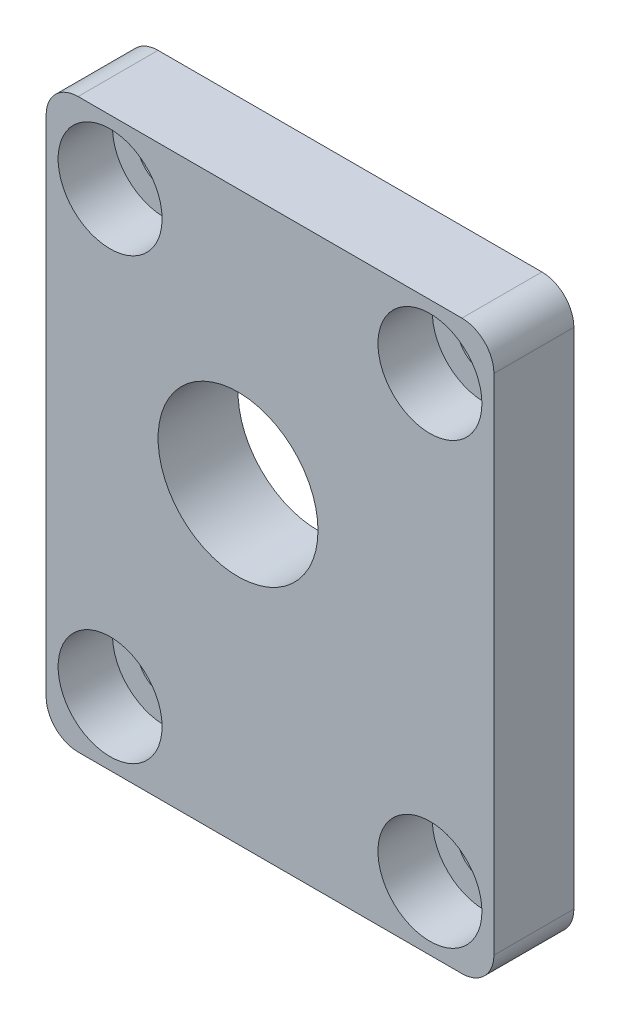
ISO-10303-21;
HEADER;
FILE_DESCRIPTION(('STEP AP214'),'2;1');
FILE_NAME('part.step','',(''),(''),'','','');
FILE_SCHEMA(('AUTOMOTIVE_DESIGN { 1 0 10303 214 1 1 1 1 }'));
ENDSEC;
DATA;
#1=APPLICATION_CONTEXT('core data for automotive mechanical design processes');
#2=APPLICATION_PROTOCOL_DEFINITION('international standard','automotive_design',2000,#1);
#3=PRODUCT_CONTEXT('',#1,'mechanical');
#4=PRODUCT('Part','Part','',(#3));
#5=PRODUCT_RELATED_PRODUCT_CATEGORY('part','',(#4));
#6=PRODUCT_DEFINITION_FORMATION('','',#4);
#7=PRODUCT_DEFINITION_CONTEXT('part definition',#1,'design');
#8=PRODUCT_DEFINITION('design','',#6,#7);
#9=PRODUCT_DEFINITION_SHAPE('','',#8);
#10=(LENGTH_UNIT() NAMED_UNIT(*) SI_UNIT(.MILLI.,.METRE.));
#11=(NAMED_UNIT(*) PLANE_ANGLE_UNIT() SI_UNIT($,.RADIAN.));
#12=(NAMED_UNIT(*) SI_UNIT($,.STERADIAN.) SOLID_ANGLE_UNIT());
#13=UNCERTAINTY_MEASURE_WITH_UNIT(LENGTH_MEASURE(1.E-05),#10,'distance_accuracy_value','');
#14=(GEOMETRIC_REPRESENTATION_CONTEXT(3) GLOBAL_UNCERTAINTY_ASSIGNED_CONTEXT((#13)) GLOBAL_UNIT_ASSIGNED_CONTEXT((#10,
#11,#12)) REPRESENTATION_CONTEXT('',''));
#15=CARTESIAN_POINT('',(0.,0.,0.));
#16=DIRECTION('',(0.,0.,1.));
#17=DIRECTION('',(1.,0.,0.));
#18=AXIS2_PLACEMENT_3D('',#15,#16,#17);
#19=CARTESIAN_POINT('',(0.,0.,5.));
#20=DIRECTION('',(0.,0.,-1.));
#21=DIRECTION('',(-1.,0.,0.));
#22=AXIS2_PLACEMENT_3D('',#19,#20,#21);
#23=PLANE('',#22);
#24=CARTESIAN_POINT('',(-10.,13.75,5.));
#25=DIRECTION('',(0.,0.,1.));
#26=DIRECTION('',(1.,0.,0.));
#27=AXIS2_PLACEMENT_3D('',#24,#25,#26);
#28=CIRCLE('',#27,3.25);
#29=CARTESIAN_POINT('',(-6.75,13.75,5.));
#30=VERTEX_POINT('',#29);
#31=EDGE_CURVE('E275',#30,#30,#28,.T.);
#32=ORIENTED_EDGE('',*,*,#31,.F.);
#33=EDGE_LOOP('',(#32));
#34=FACE_BOUND('',#33,.T.);
#35=CARTESIAN_POINT('',(10.,13.75,5.));
#36=DIRECTION('',(0.,0.,1.));
#37=DIRECTION('',(1.,0.,0.));
#38=AXIS2_PLACEMENT_3D('',#35,#36,#37);
#39=CIRCLE('',#38,3.25);
#40=CARTESIAN_POINT('',(13.25,13.75,5.));
#41=VERTEX_POINT('',#40);
#42=EDGE_CURVE('E259',#41,#41,#39,.T.);
#43=ORIENTED_EDGE('',*,*,#42,.F.);
#44=EDGE_LOOP('',(#43));
#45=FACE_BOUND('',#44,.T.);
#46=CARTESIAN_POINT('',(10.,-13.75,5.));
#47=DIRECTION('',(0.,0.,1.));
#48=DIRECTION('',(1.,0.,0.));
#49=AXIS2_PLACEMENT_3D('',#46,#47,#48);
#50=CIRCLE('',#49,3.25);
#51=CARTESIAN_POINT('',(13.25,-13.75,5.));
#52=VERTEX_POINT('',#51);
#53=EDGE_CURVE('E243',#52,#52,#50,.T.);
#54=ORIENTED_EDGE('',*,*,#53,.F.);
#55=EDGE_LOOP('',(#54));
#56=FACE_BOUND('',#55,.T.);
#57=CARTESIAN_POINT('',(-10.,-13.75,5.));
#58=DIRECTION('',(0.,0.,1.));
#59=DIRECTION('',(1.,0.,0.));
#60=AXIS2_PLACEMENT_3D('',#57,#58,#59);
#61=CIRCLE('',#60,3.25);
#62=CARTESIAN_POINT('',(-6.75,-13.75,5.));
#63=VERTEX_POINT('',#62);
#64=EDGE_CURVE('E227',#63,#63,#61,.T.);
#65=ORIENTED_EDGE('',*,*,#64,.F.);
#66=EDGE_LOOP('',(#65));
#67=FACE_BOUND('',#66,.T.);
#68=DIRECTION('',(1.,0.,0.));
#69=VECTOR('',#68,1.);
#70=CARTESIAN_POINT('',(-14.,-17.75,5.));
#71=LINE('',#70,#69);
#72=CARTESIAN_POINT('',(-12.,-17.75,5.));
#73=VERTEX_POINT('',#72);
#74=CARTESIAN_POINT('',(12.,-17.75,5.));
#75=VERTEX_POINT('',#74);
#76=EDGE_CURVE('E147',#73,#75,#71,.T.);
#77=ORIENTED_EDGE('',*,*,#76,.T.);
#78=CARTESIAN_POINT('',(12.,-15.75,5.));
#79=DIRECTION('',(0.,0.,-1.));
#80=DIRECTION('',(-1.,0.,0.));
#81=AXIS2_PLACEMENT_3D('',#78,#79,#80);
#82=CIRCLE('',#81,2.);
#83=CARTESIAN_POINT('',(14.,-15.75,5.));
#84=VERTEX_POINT('',#83);
#85=EDGE_CURVE('E177',#75,#84,#82,.F.);
#86=ORIENTED_EDGE('',*,*,#85,.T.);
#87=DIRECTION('',(0.,1.,0.));
#88=VECTOR('',#87,1.);
#89=CARTESIAN_POINT('',(14.,-17.75,5.));
#90=LINE('',#89,#88);
#91=CARTESIAN_POINT('',(14.,15.75,5.));
#92=VERTEX_POINT('',#91);
#93=EDGE_CURVE('E125',#84,#92,#90,.T.);
#94=ORIENTED_EDGE('',*,*,#93,.T.);
#95=CARTESIAN_POINT('',(12.,15.75,5.));
#96=DIRECTION('',(0.,0.,-1.));
#97=DIRECTION('',(-1.,0.,0.));
#98=AXIS2_PLACEMENT_3D('',#95,#96,#97);
#99=CIRCLE('',#98,2.);
#100=CARTESIAN_POINT('',(12.,17.75,5.));
#101=VERTEX_POINT('',#100);
#102=EDGE_CURVE('E174',#92,#101,#99,.F.);
#103=ORIENTED_EDGE('',*,*,#102,.T.);
#104=DIRECTION('',(-1.,0.,0.));
#105=VECTOR('',#104,1.);
#106=CARTESIAN_POINT('',(-14.,17.75,5.));
#107=LINE('',#106,#105);
#108=CARTESIAN_POINT('',(-12.,17.75,5.));
#109=VERTEX_POINT('',#108);
#110=EDGE_CURVE('E205',#101,#109,#107,.T.);
#111=ORIENTED_EDGE('',*,*,#110,.T.);
#112=CARTESIAN_POINT('',(-12.,15.75,5.));
#113=DIRECTION('',(0.,0.,-1.));
#114=DIRECTION('',(-1.,0.,0.));
#115=AXIS2_PLACEMENT_3D('',#112,#113,#114);
#116=CIRCLE('',#115,2.);
#117=CARTESIAN_POINT('',(-14.,15.75,5.));
#118=VERTEX_POINT('',#117);
#119=EDGE_CURVE('E59',#109,#118,#116,.F.);
#120=ORIENTED_EDGE('',*,*,#119,.T.);
#121=DIRECTION('',(0.,-1.,0.));
#122=VECTOR('',#121,1.);
#123=CARTESIAN_POINT('',(-14.,-17.75,5.));
#124=LINE('',#123,#122);
#125=CARTESIAN_POINT('',(-14.,-15.75,5.));
#126=VERTEX_POINT('',#125);
#127=EDGE_CURVE('E192',#118,#126,#124,.T.);
#128=ORIENTED_EDGE('',*,*,#127,.T.);
#129=CARTESIAN_POINT('',(-12.,-15.75,5.));
#130=DIRECTION('',(0.,0.,-1.));
#131=DIRECTION('',(-1.,0.,0.));
#132=AXIS2_PLACEMENT_3D('',#129,#130,#131);
#133=CIRCLE('',#132,2.);
#134=EDGE_CURVE('E171',#126,#73,#133,.F.);
#135=ORIENTED_EDGE('',*,*,#134,.T.);
#136=EDGE_LOOP('',(#77,#86,#94,#103,#111,#120,#128,#135));
#137=FACE_BOUND('',#136,.T.);
#138=CARTESIAN_POINT('',(-2.,1.75,5.));
#139=DIRECTION('',(0.,0.,1.));
#140=DIRECTION('',(1.,0.,0.));
#141=AXIS2_PLACEMENT_3D('',#138,#139,#140);
#142=CIRCLE('',#141,5.);
#143=CARTESIAN_POINT('',(3.00000000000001,1.75,5.));
#144=VERTEX_POINT('',#143);
#145=EDGE_CURVE('E135',#144,#144,#142,.T.);
#146=ORIENTED_EDGE('',*,*,#145,.F.);
#147=EDGE_LOOP('',(#146));
#148=FACE_BOUND('',#147,.T.);
#149=ADVANCED_FACE('F38',(#34,#45,#56,#67,#137,#148),#23,.F.);
#150=CARTESIAN_POINT('',(0.,0.,0.));
#151=DIRECTION('',(0.,0.,-1.));
#152=DIRECTION('',(-1.,0.,0.));
#153=AXIS2_PLACEMENT_3D('',#150,#151,#152);
#154=PLANE('',#153);
#155=CARTESIAN_POINT('',(-10.,13.75,0.));
#156=DIRECTION('',(0.,0.,1.));
#157=DIRECTION('',(1.,0.,0.));
#158=AXIS2_PLACEMENT_3D('',#155,#156,#157);
#159=CIRCLE('',#158,1.7);
#160=CARTESIAN_POINT('',(-8.3,13.75,0.));
#161=VERTEX_POINT('',#160);
#162=EDGE_CURVE('E263',#161,#161,#159,.T.);
#163=ORIENTED_EDGE('',*,*,#162,.T.);
#164=EDGE_LOOP('',(#163));
#165=FACE_BOUND('',#164,.T.);
#166=CARTESIAN_POINT('',(10.,13.75,0.));
#167=DIRECTION('',(0.,0.,1.));
#168=DIRECTION('',(1.,0.,0.));
#169=AXIS2_PLACEMENT_3D('',#166,#167,#168);
#170=CIRCLE('',#169,1.7);
#171=CARTESIAN_POINT('',(11.7,13.75,0.));
#172=VERTEX_POINT('',#171);
#173=EDGE_CURVE('E247',#172,#172,#170,.T.);
#174=ORIENTED_EDGE('',*,*,#173,.T.);
#175=EDGE_LOOP('',(#174));
#176=FACE_BOUND('',#175,.T.);
#177=CARTESIAN_POINT('',(10.,-13.75,0.));
#178=DIRECTION('',(0.,0.,1.));
#179=DIRECTION('',(1.,0.,0.));
#180=AXIS2_PLACEMENT_3D('',#177,#178,#179);
#181=CIRCLE('',#180,1.7);
#182=CARTESIAN_POINT('',(11.7,-13.75,0.));
#183=VERTEX_POINT('',#182);
#184=EDGE_CURVE('E231',#183,#183,#181,.T.);
#185=ORIENTED_EDGE('',*,*,#184,.T.);
#186=EDGE_LOOP('',(#185));
#187=FACE_BOUND('',#186,.T.);
#188=CARTESIAN_POINT('',(-10.,-13.75,0.));
#189=DIRECTION('',(0.,0.,1.));
#190=DIRECTION('',(1.,0.,0.));
#191=AXIS2_PLACEMENT_3D('',#188,#189,#190);
#192=CIRCLE('',#191,1.7);
#193=CARTESIAN_POINT('',(-8.3,-13.75,0.));
#194=VERTEX_POINT('',#193);
#195=EDGE_CURVE('E214',#194,#194,#192,.T.);
#196=ORIENTED_EDGE('',*,*,#195,.T.);
#197=EDGE_LOOP('',(#196));
#198=FACE_BOUND('',#197,.T.);
#199=DIRECTION('',(0.,1.,0.));
#200=VECTOR('',#199,1.);
#201=CARTESIAN_POINT('',(14.,-17.75,0.));
#202=LINE('',#201,#200);
#203=CARTESIAN_POINT('',(14.,-15.75,0.));
#204=VERTEX_POINT('',#203);
#205=CARTESIAN_POINT('',(14.,15.75,0.));
#206=VERTEX_POINT('',#205);
#207=EDGE_CURVE('E122',#204,#206,#202,.T.);
#208=ORIENTED_EDGE('',*,*,#207,.F.);
#209=CARTESIAN_POINT('',(12.,-15.75,0.));
#210=DIRECTION('',(0.,0.,-1.));
#211=DIRECTION('',(-1.,0.,0.));
#212=AXIS2_PLACEMENT_3D('',#209,#210,#211);
#213=CIRCLE('',#212,2.);
#214=CARTESIAN_POINT('',(12.,-17.75,0.));
#215=VERTEX_POINT('',#214);
#216=EDGE_CURVE('E104',#204,#215,#213,.T.);
#217=ORIENTED_EDGE('',*,*,#216,.T.);
#218=DIRECTION('',(1.,0.,0.));
#219=VECTOR('',#218,1.);
#220=CARTESIAN_POINT('',(-14.,-17.75,0.));
#221=LINE('',#220,#219);
#222=CARTESIAN_POINT('',(-12.,-17.75,0.));
#223=VERTEX_POINT('',#222);
#224=EDGE_CURVE('E152',#223,#215,#221,.T.);
#225=ORIENTED_EDGE('',*,*,#224,.F.);
#226=CARTESIAN_POINT('',(-12.,-15.75,0.));
#227=DIRECTION('',(0.,0.,-1.));
#228=DIRECTION('',(-1.,0.,0.));
#229=AXIS2_PLACEMENT_3D('',#226,#227,#228);
#230=CIRCLE('',#229,2.);
#231=CARTESIAN_POINT('',(-14.,-15.75,0.));
#232=VERTEX_POINT('',#231);
#233=EDGE_CURVE('E159',#223,#232,#230,.T.);
#234=ORIENTED_EDGE('',*,*,#233,.T.);
#235=DIRECTION('',(0.,-1.,0.));
#236=VECTOR('',#235,1.);
#237=CARTESIAN_POINT('',(-14.,-17.75,0.));
#238=LINE('',#237,#236);
#239=CARTESIAN_POINT('',(-14.,15.75,0.));
#240=VERTEX_POINT('',#239);
#241=EDGE_CURVE('E141',#240,#232,#238,.T.);
#242=ORIENTED_EDGE('',*,*,#241,.F.);
#243=CARTESIAN_POINT('',(-12.,15.75,0.));
#244=DIRECTION('',(0.,0.,-1.));
#245=DIRECTION('',(-1.,0.,0.));
#246=AXIS2_PLACEMENT_3D('',#243,#244,#245);
#247=CIRCLE('',#246,2.);
#248=CARTESIAN_POINT('',(-12.,17.75,0.));
#249=VERTEX_POINT('',#248);
#250=EDGE_CURVE('E127',#240,#249,#247,.T.);
#251=ORIENTED_EDGE('',*,*,#250,.T.);
#252=DIRECTION('',(-1.,0.,0.));
#253=VECTOR('',#252,1.);
#254=CARTESIAN_POINT('',(-14.,17.75,0.));
#255=LINE('',#254,#253);
#256=CARTESIAN_POINT('',(12.,17.75,0.));
#257=VERTEX_POINT('',#256);
#258=EDGE_CURVE('E134',#257,#249,#255,.T.);
#259=ORIENTED_EDGE('',*,*,#258,.F.);
#260=CARTESIAN_POINT('',(12.,15.75,0.));
#261=DIRECTION('',(0.,0.,-1.));
#262=DIRECTION('',(-1.,0.,0.));
#263=AXIS2_PLACEMENT_3D('',#260,#261,#262);
#264=CIRCLE('',#263,2.);
#265=EDGE_CURVE('E116',#257,#206,#264,.T.);
#266=ORIENTED_EDGE('',*,*,#265,.T.);
#267=EDGE_LOOP('',(#208,#217,#225,#234,#242,#251,#259,#266));
#268=FACE_BOUND('',#267,.T.);
#269=CARTESIAN_POINT('',(-2.,1.75,0.));
#270=DIRECTION('',(0.,0.,1.));
#271=DIRECTION('',(1.,0.,0.));
#272=AXIS2_PLACEMENT_3D('',#269,#270,#271);
#273=CIRCLE('',#272,5.);
#274=CARTESIAN_POINT('',(3.00000000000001,1.75,0.));
#275=VERTEX_POINT('',#274);
#276=EDGE_CURVE('E144',#275,#275,#273,.T.);
#277=ORIENTED_EDGE('',*,*,#276,.T.);
#278=EDGE_LOOP('',(#277));
#279=FACE_BOUND('',#278,.T.);
#280=ADVANCED_FACE('F130',(#165,#176,#187,#198,#268,#279),#154,.T.);
#281=CARTESIAN_POINT('',(14.,-17.75,5.));
#282=DIRECTION('',(-1.,0.,0.));
#283=DIRECTION('',(0.,0.,1.));
#284=AXIS2_PLACEMENT_3D('',#281,#282,#283);
#285=PLANE('',#284);
#286=ORIENTED_EDGE('',*,*,#93,.F.);
#287=DIRECTION('',(0.,0.,-1.));
#288=VECTOR('',#287,1.);
#289=CARTESIAN_POINT('',(14.,-15.75,5.));
#290=LINE('',#289,#288);
#291=EDGE_CURVE('E108',#84,#204,#290,.T.);
#292=ORIENTED_EDGE('',*,*,#291,.T.);
#293=ORIENTED_EDGE('',*,*,#207,.T.);
#294=DIRECTION('',(0.,0.,-1.));
#295=VECTOR('',#294,1.);
#296=CARTESIAN_POINT('',(14.,15.75,5.));
#297=LINE('',#296,#295);
#298=EDGE_CURVE('E128',#206,#92,#297,.F.);
#299=ORIENTED_EDGE('',*,*,#298,.T.);
#300=EDGE_LOOP('',(#286,#292,#293,#299));
#301=FACE_BOUND('',#300,.T.);
#302=ADVANCED_FACE('F121',(#301),#285,.F.);
#303=CARTESIAN_POINT('',(-14.,17.75,5.));
#304=DIRECTION('',(0.,-1.,0.));
#305=DIRECTION('',(0.,0.,-1.));
#306=AXIS2_PLACEMENT_3D('',#303,#304,#305);
#307=PLANE('',#306);
#308=ORIENTED_EDGE('',*,*,#110,.F.);
#309=DIRECTION('',(0.,0.,-1.));
#310=VECTOR('',#309,1.);
#311=CARTESIAN_POINT('',(12.,17.75,5.));
#312=LINE('',#311,#310);
#313=EDGE_CURVE('E183',#101,#257,#312,.T.);
#314=ORIENTED_EDGE('',*,*,#313,.T.);
#315=ORIENTED_EDGE('',*,*,#258,.T.);
#316=DIRECTION('',(0.,0.,-1.));
#317=VECTOR('',#316,1.);
#318=CARTESIAN_POINT('',(-12.,17.75,5.));
#319=LINE('',#318,#317);
#320=EDGE_CURVE('E180',#249,#109,#319,.F.);
#321=ORIENTED_EDGE('',*,*,#320,.T.);
#322=EDGE_LOOP('',(#308,#314,#315,#321));
#323=FACE_BOUND('',#322,.T.);
#324=ADVANCED_FACE('F306',(#323),#307,.F.);
#325=CARTESIAN_POINT('',(-14.,-17.75,5.));
#326=DIRECTION('',(1.,0.,0.));
#327=DIRECTION('',(0.,0.,-1.));
#328=AXIS2_PLACEMENT_3D('',#325,#326,#327);
#329=PLANE('',#328);
#330=ORIENTED_EDGE('',*,*,#241,.T.);
#331=DIRECTION('',(0.,0.,-1.));
#332=VECTOR('',#331,1.);
#333=CARTESIAN_POINT('',(-14.,-15.75,5.));
#334=LINE('',#333,#332);
#335=EDGE_CURVE('E11',#232,#126,#334,.F.);
#336=ORIENTED_EDGE('',*,*,#335,.T.);
#337=ORIENTED_EDGE('',*,*,#127,.F.);
#338=DIRECTION('',(0.,0.,-1.));
#339=VECTOR('',#338,1.);
#340=CARTESIAN_POINT('',(-14.,15.75,5.));
#341=LINE('',#340,#339);
#342=EDGE_CURVE('E47',#118,#240,#341,.T.);
#343=ORIENTED_EDGE('',*,*,#342,.T.);
#344=EDGE_LOOP('',(#330,#336,#337,#343));
#345=FACE_BOUND('',#344,.T.);
#346=ADVANCED_FACE('F191',(#345),#329,.F.);
#347=CARTESIAN_POINT('',(-14.,-17.75,5.));
#348=DIRECTION('',(0.,1.,0.));
#349=DIRECTION('',(0.,0.,1.));
#350=AXIS2_PLACEMENT_3D('',#347,#348,#349);
#351=PLANE('',#350);
#352=ORIENTED_EDGE('',*,*,#224,.T.);
#353=DIRECTION('',(0.,0.,-1.));
#354=VECTOR('',#353,1.);
#355=CARTESIAN_POINT('',(12.,-17.75,5.));
#356=LINE('',#355,#354);
#357=EDGE_CURVE('E109',#215,#75,#356,.F.);
#358=ORIENTED_EDGE('',*,*,#357,.T.);
#359=ORIENTED_EDGE('',*,*,#76,.F.);
#360=DIRECTION('',(0.,0.,-1.));
#361=VECTOR('',#360,1.);
#362=CARTESIAN_POINT('',(-12.,-17.75,5.));
#363=LINE('',#362,#361);
#364=EDGE_CURVE('E115',#73,#223,#363,.T.);
#365=ORIENTED_EDGE('',*,*,#364,.T.);
#366=EDGE_LOOP('',(#352,#358,#359,#365));
#367=FACE_BOUND('',#366,.T.);
#368=ADVANCED_FACE('F200',(#367),#351,.F.);
#369=CARTESIAN_POINT('',(-2.,1.75,5.));
#370=DIRECTION('',(0.,0.,-1.));
#371=DIRECTION('',(-1.,0.,0.));
#372=AXIS2_PLACEMENT_3D('',#369,#370,#371);
#373=CYLINDRICAL_SURFACE('',#372,5.);
#374=ORIENTED_EDGE('',*,*,#145,.T.);
#375=EDGE_LOOP('',(#374));
#376=FACE_BOUND('',#375,.T.);
#377=ORIENTED_EDGE('',*,*,#276,.F.);
#378=EDGE_LOOP('',(#377));
#379=FACE_BOUND('',#378,.T.);
#380=ADVANCED_FACE('F294',(#376,#379),#373,.F.);
#381=CARTESIAN_POINT('',(-10.,-13.75,5.));
#382=DIRECTION('',(0.,0.,1.));
#383=DIRECTION('',(1.,0.,0.));
#384=AXIS2_PLACEMENT_3D('',#381,#382,#383);
#385=CYLINDRICAL_SURFACE('',#384,1.70000000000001);
#386=ORIENTED_EDGE('',*,*,#195,.F.);
#387=EDGE_LOOP('',(#386));
#388=FACE_BOUND('',#387,.T.);
#389=CARTESIAN_POINT('',(-10.,-13.75,1.6));
#390=DIRECTION('',(0.,0.,1.));
#391=DIRECTION('',(1.,0.,0.));
#392=AXIS2_PLACEMENT_3D('',#389,#390,#391);
#393=CIRCLE('',#392,1.70000000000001);
#394=CARTESIAN_POINT('',(-8.29999999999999,-13.75,1.6));
#395=VERTEX_POINT('',#394);
#396=EDGE_CURVE('E219',#395,#395,#393,.T.);
#397=ORIENTED_EDGE('',*,*,#396,.T.);
#398=EDGE_LOOP('',(#397));
#399=FACE_BOUND('',#398,.T.);
#400=ADVANCED_FACE('F297',(#388,#399),#385,.F.);
#401=CARTESIAN_POINT('',(-8.29999999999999,-13.75,1.6));
#402=DIRECTION('',(0.,0.,-1.));
#403=DIRECTION('',(-1.,0.,0.));
#404=AXIS2_PLACEMENT_3D('',#401,#402,#403);
#405=PLANE('',#404);
#406=ORIENTED_EDGE('',*,*,#396,.F.);
#407=EDGE_LOOP('',(#406));
#408=FACE_BOUND('',#407,.T.);
#409=CARTESIAN_POINT('',(-10.,-13.75,1.6));
#410=DIRECTION('',(0.,0.,1.));
#411=DIRECTION('',(1.,0.,0.));
#412=AXIS2_PLACEMENT_3D('',#409,#410,#411);
#413=CIRCLE('',#412,3.25);
#414=CARTESIAN_POINT('',(-6.75,-13.75,1.6));
#415=VERTEX_POINT('',#414);
#416=EDGE_CURVE('E223',#415,#415,#413,.T.);
#417=ORIENTED_EDGE('',*,*,#416,.T.);
#418=EDGE_LOOP('',(#417));
#419=FACE_BOUND('',#418,.T.);
#420=ADVANCED_FACE('F449',(#408,#419),#405,.F.);
#421=CARTESIAN_POINT('',(-10.,-13.75,5.));
#422=DIRECTION('',(0.,0.,1.));
#423=DIRECTION('',(1.,0.,0.));
#424=AXIS2_PLACEMENT_3D('',#421,#422,#423);
#425=CYLINDRICAL_SURFACE('',#424,3.25);
#426=ORIENTED_EDGE('',*,*,#416,.F.);
#427=EDGE_LOOP('',(#426));
#428=FACE_BOUND('',#427,.T.);
#429=ORIENTED_EDGE('',*,*,#64,.T.);
#430=EDGE_LOOP('',(#429));
#431=FACE_BOUND('',#430,.T.);
#432=ADVANCED_FACE('F439',(#428,#431),#425,.F.);
#433=CARTESIAN_POINT('',(10.,-13.75,5.));
#434=DIRECTION('',(0.,0.,1.));
#435=DIRECTION('',(1.,0.,0.));
#436=AXIS2_PLACEMENT_3D('',#433,#434,#435);
#437=CYLINDRICAL_SURFACE('',#436,1.70000000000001);
#438=ORIENTED_EDGE('',*,*,#184,.F.);
#439=EDGE_LOOP('',(#438));
#440=FACE_BOUND('',#439,.T.);
#441=CARTESIAN_POINT('',(10.,-13.75,1.6));
#442=DIRECTION('',(0.,0.,1.));
#443=DIRECTION('',(1.,0.,0.));
#444=AXIS2_PLACEMENT_3D('',#441,#442,#443);
#445=CIRCLE('',#444,1.70000000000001);
#446=CARTESIAN_POINT('',(11.7,-13.75,1.6));
#447=VERTEX_POINT('',#446);
#448=EDGE_CURVE('E235',#447,#447,#445,.T.);
#449=ORIENTED_EDGE('',*,*,#448,.T.);
#450=EDGE_LOOP('',(#449));
#451=FACE_BOUND('',#450,.T.);
#452=ADVANCED_FACE('F429',(#440,#451),#437,.F.);
#453=CARTESIAN_POINT('',(11.7,-13.75,1.6));
#454=DIRECTION('',(0.,0.,-1.));
#455=DIRECTION('',(-1.,0.,0.));
#456=AXIS2_PLACEMENT_3D('',#453,#454,#455);
#457=PLANE('',#456);
#458=ORIENTED_EDGE('',*,*,#448,.F.);
#459=EDGE_LOOP('',(#458));
#460=FACE_BOUND('',#459,.T.);
#461=CARTESIAN_POINT('',(10.,-13.75,1.6));
#462=DIRECTION('',(0.,0.,1.));
#463=DIRECTION('',(1.,0.,0.));
#464=AXIS2_PLACEMENT_3D('',#461,#462,#463);
#465=CIRCLE('',#464,3.25);
#466=CARTESIAN_POINT('',(13.25,-13.75,1.6));
#467=VERTEX_POINT('',#466);
#468=EDGE_CURVE('E239',#467,#467,#465,.T.);
#469=ORIENTED_EDGE('',*,*,#468,.T.);
#470=EDGE_LOOP('',(#469));
#471=FACE_BOUND('',#470,.T.);
#472=ADVANCED_FACE('F419',(#460,#471),#457,.F.);
#473=CARTESIAN_POINT('',(10.,-13.75,5.));
#474=DIRECTION('',(0.,0.,1.));
#475=DIRECTION('',(1.,0.,0.));
#476=AXIS2_PLACEMENT_3D('',#473,#474,#475);
#477=CYLINDRICAL_SURFACE('',#476,3.25);
#478=ORIENTED_EDGE('',*,*,#468,.F.);
#479=EDGE_LOOP('',(#478));
#480=FACE_BOUND('',#479,.T.);
#481=ORIENTED_EDGE('',*,*,#53,.T.);
#482=EDGE_LOOP('',(#481));
#483=FACE_BOUND('',#482,.T.);
#484=ADVANCED_FACE('F409',(#480,#483),#477,.F.);
#485=CARTESIAN_POINT('',(10.,13.75,5.));
#486=DIRECTION('',(0.,0.,1.));
#487=DIRECTION('',(1.,0.,0.));
#488=AXIS2_PLACEMENT_3D('',#485,#486,#487);
#489=CYLINDRICAL_SURFACE('',#488,1.70000000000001);
#490=ORIENTED_EDGE('',*,*,#173,.F.);
#491=EDGE_LOOP('',(#490));
#492=FACE_BOUND('',#491,.T.);
#493=CARTESIAN_POINT('',(10.,13.75,1.6));
#494=DIRECTION('',(0.,0.,1.));
#495=DIRECTION('',(1.,0.,0.));
#496=AXIS2_PLACEMENT_3D('',#493,#494,#495);
#497=CIRCLE('',#496,1.70000000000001);
#498=CARTESIAN_POINT('',(11.7,13.75,1.6));
#499=VERTEX_POINT('',#498);
#500=EDGE_CURVE('E251',#499,#499,#497,.T.);
#501=ORIENTED_EDGE('',*,*,#500,.T.);
#502=EDGE_LOOP('',(#501));
#503=FACE_BOUND('',#502,.T.);
#504=ADVANCED_FACE('F399',(#492,#503),#489,.F.);
#505=CARTESIAN_POINT('',(11.7,13.75,1.6));
#506=DIRECTION('',(0.,0.,-1.));
#507=DIRECTION('',(-1.,0.,0.));
#508=AXIS2_PLACEMENT_3D('',#505,#506,#507);
#509=PLANE('',#508);
#510=ORIENTED_EDGE('',*,*,#500,.F.);
#511=EDGE_LOOP('',(#510));
#512=FACE_BOUND('',#511,.T.);
#513=CARTESIAN_POINT('',(10.,13.75,1.6));
#514=DIRECTION('',(0.,0.,1.));
#515=DIRECTION('',(1.,0.,0.));
#516=AXIS2_PLACEMENT_3D('',#513,#514,#515);
#517=CIRCLE('',#516,3.25);
#518=CARTESIAN_POINT('',(13.25,13.75,1.6));
#519=VERTEX_POINT('',#518);
#520=EDGE_CURVE('E255',#519,#519,#517,.T.);
#521=ORIENTED_EDGE('',*,*,#520,.T.);
#522=EDGE_LOOP('',(#521));
#523=FACE_BOUND('',#522,.T.);
#524=ADVANCED_FACE('F389',(#512,#523),#509,.F.);
#525=CARTESIAN_POINT('',(10.,13.75,5.));
#526=DIRECTION('',(0.,0.,1.));
#527=DIRECTION('',(1.,0.,0.));
#528=AXIS2_PLACEMENT_3D('',#525,#526,#527);
#529=CYLINDRICAL_SURFACE('',#528,3.25);
#530=ORIENTED_EDGE('',*,*,#520,.F.);
#531=EDGE_LOOP('',(#530));
#532=FACE_BOUND('',#531,.T.);
#533=ORIENTED_EDGE('',*,*,#42,.T.);
#534=EDGE_LOOP('',(#533));
#535=FACE_BOUND('',#534,.T.);
#536=ADVANCED_FACE('F379',(#532,#535),#529,.F.);
#537=CARTESIAN_POINT('',(-10.,13.75,5.));
#538=DIRECTION('',(0.,0.,1.));
#539=DIRECTION('',(1.,0.,0.));
#540=AXIS2_PLACEMENT_3D('',#537,#538,#539);
#541=CYLINDRICAL_SURFACE('',#540,1.70000000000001);
#542=ORIENTED_EDGE('',*,*,#162,.F.);
#543=EDGE_LOOP('',(#542));
#544=FACE_BOUND('',#543,.T.);
#545=CARTESIAN_POINT('',(-10.,13.75,1.6));
#546=DIRECTION('',(0.,0.,1.));
#547=DIRECTION('',(1.,0.,0.));
#548=AXIS2_PLACEMENT_3D('',#545,#546,#547);
#549=CIRCLE('',#548,1.70000000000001);
#550=CARTESIAN_POINT('',(-8.29999999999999,13.75,1.6));
#551=VERTEX_POINT('',#550);
#552=EDGE_CURVE('E267',#551,#551,#549,.T.);
#553=ORIENTED_EDGE('',*,*,#552,.T.);
#554=EDGE_LOOP('',(#553));
#555=FACE_BOUND('',#554,.T.);
#556=ADVANCED_FACE('F369',(#544,#555),#541,.F.);
#557=CARTESIAN_POINT('',(-8.29999999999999,13.75,1.6));
#558=DIRECTION('',(0.,0.,-1.));
#559=DIRECTION('',(-1.,0.,0.));
#560=AXIS2_PLACEMENT_3D('',#557,#558,#559);
#561=PLANE('',#560);
#562=ORIENTED_EDGE('',*,*,#552,.F.);
#563=EDGE_LOOP('',(#562));
#564=FACE_BOUND('',#563,.T.);
#565=CARTESIAN_POINT('',(-10.,13.75,1.6));
#566=DIRECTION('',(0.,0.,1.));
#567=DIRECTION('',(1.,0.,0.));
#568=AXIS2_PLACEMENT_3D('',#565,#566,#567);
#569=CIRCLE('',#568,3.25);
#570=CARTESIAN_POINT('',(-6.75,13.75,1.6));
#571=VERTEX_POINT('',#570);
#572=EDGE_CURVE('E271',#571,#571,#569,.T.);
#573=ORIENTED_EDGE('',*,*,#572,.T.);
#574=EDGE_LOOP('',(#573));
#575=FACE_BOUND('',#574,.T.);
#576=ADVANCED_FACE('F358',(#564,#575),#561,.F.);
#577=CARTESIAN_POINT('',(-10.,13.75,5.));
#578=DIRECTION('',(0.,0.,1.));
#579=DIRECTION('',(1.,0.,0.));
#580=AXIS2_PLACEMENT_3D('',#577,#578,#579);
#581=CYLINDRICAL_SURFACE('',#580,3.25);
#582=ORIENTED_EDGE('',*,*,#572,.F.);
#583=EDGE_LOOP('',(#582));
#584=FACE_BOUND('',#583,.T.);
#585=ORIENTED_EDGE('',*,*,#31,.T.);
#586=EDGE_LOOP('',(#585));
#587=FACE_BOUND('',#586,.T.);
#588=ADVANCED_FACE('F281',(#584,#587),#581,.F.);
#589=CARTESIAN_POINT('',(12.,-15.75,5.));
#590=DIRECTION('',(0.,0.,-1.));
#591=DIRECTION('',(-1.,0.,0.));
#592=AXIS2_PLACEMENT_3D('',#589,#590,#591);
#593=CYLINDRICAL_SURFACE('',#592,2.);
#594=ORIENTED_EDGE('',*,*,#85,.F.);
#595=ORIENTED_EDGE('',*,*,#357,.F.);
#596=ORIENTED_EDGE('',*,*,#216,.F.);
#597=ORIENTED_EDGE('',*,*,#291,.F.);
#598=EDGE_LOOP('',(#594,#595,#596,#597));
#599=FACE_BOUND('',#598,.T.);
#600=ADVANCED_FACE('F107',(#599),#593,.T.);
#601=CARTESIAN_POINT('',(12.,15.75,5.));
#602=DIRECTION('',(0.,0.,-1.));
#603=DIRECTION('',(-1.,0.,0.));
#604=AXIS2_PLACEMENT_3D('',#601,#602,#603);
#605=CYLINDRICAL_SURFACE('',#604,2.);
#606=ORIENTED_EDGE('',*,*,#102,.F.);
#607=ORIENTED_EDGE('',*,*,#298,.F.);
#608=ORIENTED_EDGE('',*,*,#265,.F.);
#609=ORIENTED_EDGE('',*,*,#313,.F.);
#610=EDGE_LOOP('',(#606,#607,#608,#609));
#611=FACE_BOUND('',#610,.T.);
#612=ADVANCED_FACE('F319',(#611),#605,.T.);
#613=CARTESIAN_POINT('',(-12.,-15.75,5.));
#614=DIRECTION('',(0.,0.,-1.));
#615=DIRECTION('',(-1.,0.,0.));
#616=AXIS2_PLACEMENT_3D('',#613,#614,#615);
#617=CYLINDRICAL_SURFACE('',#616,2.);
#618=ORIENTED_EDGE('',*,*,#134,.F.);
#619=ORIENTED_EDGE('',*,*,#335,.F.);
#620=ORIENTED_EDGE('',*,*,#233,.F.);
#621=ORIENTED_EDGE('',*,*,#364,.F.);
#622=EDGE_LOOP('',(#618,#619,#620,#621));
#623=FACE_BOUND('',#622,.T.);
#624=ADVANCED_FACE('F197',(#623),#617,.T.);
#625=CARTESIAN_POINT('',(-12.,15.75,5.));
#626=DIRECTION('',(0.,0.,-1.));
#627=DIRECTION('',(-1.,0.,0.));
#628=AXIS2_PLACEMENT_3D('',#625,#626,#627);
#629=CYLINDRICAL_SURFACE('',#628,2.);
#630=ORIENTED_EDGE('',*,*,#119,.F.);
#631=ORIENTED_EDGE('',*,*,#320,.F.);
#632=ORIENTED_EDGE('',*,*,#250,.F.);
#633=ORIENTED_EDGE('',*,*,#342,.F.);
#634=EDGE_LOOP('',(#630,#631,#632,#633));
#635=FACE_BOUND('',#634,.T.);
#636=ADVANCED_FACE('F40',(#635),#629,.T.);
#637=CLOSED_SHELL('',(#149,#280,#302,#324,#346,#368,#380,#400,#420,#432,#452,#472,#484,#504,
#524,#536,#556,#576,#588,#600,#612,#624,#636));
#638=MANIFOLD_SOLID_BREP('B2',#637);
#639=ADVANCED_BREP_SHAPE_REPRESENTATION('',(#18,#638),#14);
#640=SHAPE_DEFINITION_REPRESENTATION(#9,#639);
ENDSEC;
END-ISO-10303-21;
